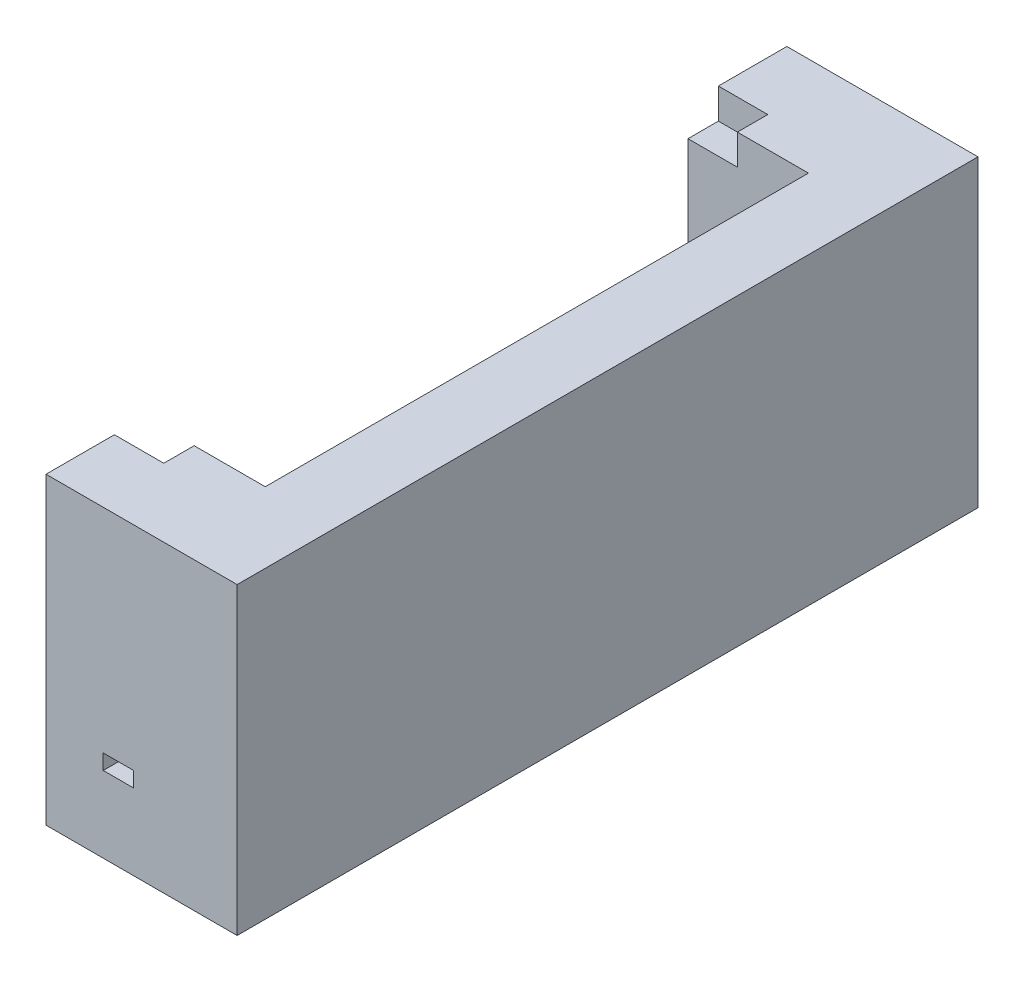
ISO-10303-21;
HEADER;
FILE_DESCRIPTION(('STEP AP214'),'2;1');
FILE_NAME('part.step','',(''),(''),'','','');
FILE_SCHEMA(('AUTOMOTIVE_DESIGN { 1 0 10303 214 1 1 1 1 }'));
ENDSEC;
DATA;
#1=APPLICATION_CONTEXT('core data for automotive mechanical design processes');
#2=APPLICATION_PROTOCOL_DEFINITION('international standard','automotive_design',2000,#1);
#3=PRODUCT_CONTEXT('',#1,'mechanical');
#4=PRODUCT('Part','Part','',(#3));
#5=PRODUCT_RELATED_PRODUCT_CATEGORY('part','',(#4));
#6=PRODUCT_DEFINITION_FORMATION('','',#4);
#7=PRODUCT_DEFINITION_CONTEXT('part definition',#1,'design');
#8=PRODUCT_DEFINITION('design','',#6,#7);
#9=PRODUCT_DEFINITION_SHAPE('','',#8);
#10=(LENGTH_UNIT() NAMED_UNIT(*) SI_UNIT(.MILLI.,.METRE.));
#11=(NAMED_UNIT(*) PLANE_ANGLE_UNIT() SI_UNIT($,.RADIAN.));
#12=(NAMED_UNIT(*) SI_UNIT($,.STERADIAN.) SOLID_ANGLE_UNIT());
#13=UNCERTAINTY_MEASURE_WITH_UNIT(LENGTH_MEASURE(1.E-05),#10,'distance_accuracy_value','');
#14=(GEOMETRIC_REPRESENTATION_CONTEXT(3) GLOBAL_UNCERTAINTY_ASSIGNED_CONTEXT((#13)) GLOBAL_UNIT_ASSIGNED_CONTEXT((#10,
#11,#12)) REPRESENTATION_CONTEXT('',''));
#15=CARTESIAN_POINT('',(0.,0.,0.));
#16=DIRECTION('',(0.,0.,1.));
#17=DIRECTION('',(1.,0.,0.));
#18=AXIS2_PLACEMENT_3D('',#15,#16,#17);
#19=CARTESIAN_POINT('',(39.5032063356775,22.3385551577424,0.));
#20=DIRECTION('',(-1.,0.,0.));
#21=DIRECTION('',(0.,0.,1.));
#22=AXIS2_PLACEMENT_3D('',#19,#20,#21);
#23=PLANE('',#22);
#24=DIRECTION('',(0.,0.,-1.));
#25=VECTOR('',#24,1.);
#26=CARTESIAN_POINT('',(39.5032063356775,19.9385551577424,0.));
#27=LINE('',#26,#25);
#28=CARTESIAN_POINT('',(39.5032063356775,19.9385551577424,14.9045368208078));
#29=VERTEX_POINT('',#28);
#30=CARTESIAN_POINT('',(39.5032063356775,19.9385551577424,-0.109398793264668));
#31=VERTEX_POINT('',#30);
#32=EDGE_CURVE('E406',#29,#31,#27,.T.);
#33=ORIENTED_EDGE('',*,*,#32,.T.);
#34=DIRECTION('',(0.,-1.,0.));
#35=VECTOR('',#34,1.);
#36=CARTESIAN_POINT('',(39.5032063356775,19.9385551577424,-0.10939879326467));
#37=LINE('',#36,#35);
#38=CARTESIAN_POINT('',(39.5032063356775,12.3385551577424,-0.10939879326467));
#39=VERTEX_POINT('',#38);
#40=EDGE_CURVE('E378',#31,#39,#37,.T.);
#41=ORIENTED_EDGE('',*,*,#40,.T.);
#42=DIRECTION('',(0.,0.,1.));
#43=VECTOR('',#42,1.);
#44=CARTESIAN_POINT('',(39.5032063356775,12.3385551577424,0.));
#45=LINE('',#44,#43);
#46=CARTESIAN_POINT('',(39.5032063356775,12.3385551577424,14.9045368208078));
#47=VERTEX_POINT('',#46);
#48=EDGE_CURVE('E137',#39,#47,#45,.T.);
#49=ORIENTED_EDGE('',*,*,#48,.T.);
#50=DIRECTION('',(0.,-1.,0.));
#51=VECTOR('',#50,1.);
#52=CARTESIAN_POINT('',(39.5032063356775,19.9385551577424,14.9045368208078));
#53=LINE('',#52,#51);
#54=EDGE_CURVE('E396',#29,#47,#53,.T.);
#55=ORIENTED_EDGE('',*,*,#54,.F.);
#56=EDGE_LOOP('',(#33,#41,#49,#55));
#57=FACE_BOUND('',#56,.T.);
#58=ADVANCED_FACE('F129',(#57),#23,.T.);
#59=CARTESIAN_POINT('',(31.8495376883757,22.3385551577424,0.));
#60=DIRECTION('',(-1.,0.,0.));
#61=DIRECTION('',(0.,0.,1.));
#62=AXIS2_PLACEMENT_3D('',#59,#60,#61);
#63=PLANE('',#62);
#64=DIRECTION('',(0.,0.,1.));
#65=VECTOR('',#64,1.);
#66=CARTESIAN_POINT('',(31.8495376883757,19.9385551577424,-14.9412263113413));
#67=LINE('',#66,#65);
#68=CARTESIAN_POINT('',(31.8495376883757,19.9385551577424,-11.8264503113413));
#69=VERTEX_POINT('',#68);
#70=CARTESIAN_POINT('',(31.8495376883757,19.9385551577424,-0.109398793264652));
#71=VERTEX_POINT('',#70);
#72=EDGE_CURVE('E345',#69,#71,#67,.T.);
#73=ORIENTED_EDGE('',*,*,#72,.F.);
#74=DIRECTION('',(0.,-1.,0.));
#75=VECTOR('',#74,1.);
#76=CARTESIAN_POINT('',(31.8495376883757,42.3385551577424,-11.8264503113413));
#77=LINE('',#76,#75);
#78=CARTESIAN_POINT('',(31.8495376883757,22.3385551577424,-11.8264502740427));
#79=VERTEX_POINT('',#78);
#80=EDGE_CURVE('E357',#79,#69,#77,.T.);
#81=ORIENTED_EDGE('',*,*,#80,.F.);
#82=DIRECTION('',(0.,0.,-1.));
#83=VECTOR('',#82,1.);
#84=CARTESIAN_POINT('',(31.8495376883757,22.3385551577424,0.));
#85=LINE('',#84,#83);
#86=CARTESIAN_POINT('',(31.8495376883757,22.3385551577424,59.6587736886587));
#87=VERTEX_POINT('',#86);
#88=EDGE_CURVE('E608',#87,#79,#85,.T.);
#89=ORIENTED_EDGE('',*,*,#88,.F.);
#90=DIRECTION('',(0.,1.,0.));
#91=VECTOR('',#90,1.);
#92=CARTESIAN_POINT('',(31.8495376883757,42.3385551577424,59.6587736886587));
#93=LINE('',#92,#91);
#94=CARTESIAN_POINT('',(31.8495376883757,19.9385551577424,59.6587736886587));
#95=VERTEX_POINT('',#94);
#96=EDGE_CURVE('E363',#95,#87,#93,.T.);
#97=ORIENTED_EDGE('',*,*,#96,.F.);
#98=CARTESIAN_POINT('',(31.8495376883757,19.9385551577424,46.7045368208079));
#99=VERTEX_POINT('',#98);
#100=EDGE_CURVE('E399',#99,#95,#67,.T.);
#101=ORIENTED_EDGE('',*,*,#100,.F.);
#102=DIRECTION('',(0.,-1.,0.));
#103=VECTOR('',#102,1.);
#104=CARTESIAN_POINT('',(31.8495376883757,20.0885551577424,46.7045368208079));
#105=LINE('',#104,#103);
#106=CARTESIAN_POINT('',(31.8495376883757,12.3385551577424,46.7045368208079));
#107=VERTEX_POINT('',#106);
#108=EDGE_CURVE('E428',#99,#107,#105,.T.);
#109=ORIENTED_EDGE('',*,*,#108,.T.);
#110=DIRECTION('',(0.,0.,1.));
#111=VECTOR('',#110,1.);
#112=CARTESIAN_POINT('',(31.8495376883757,12.3385551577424,48.4363643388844));
#113=LINE('',#112,#111);
#114=CARTESIAN_POINT('',(31.8495376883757,12.3385551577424,31.6906012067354));
#115=VERTEX_POINT('',#114);
#116=EDGE_CURVE('E611',#115,#107,#113,.T.);
#117=ORIENTED_EDGE('',*,*,#116,.F.);
#118=DIRECTION('',(0.,-1.,0.));
#119=VECTOR('',#118,1.);
#120=CARTESIAN_POINT('',(31.8495376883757,20.0885551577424,31.6906012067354));
#121=LINE('',#120,#119);
#122=CARTESIAN_POINT('',(31.8495376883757,19.9385551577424,31.6906012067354));
#123=VERTEX_POINT('',#122);
#124=EDGE_CURVE('E422',#123,#115,#121,.T.);
#125=ORIENTED_EDGE('',*,*,#124,.F.);
#126=CARTESIAN_POINT('',(31.8495376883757,19.9385551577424,14.9045368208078));
#127=VERTEX_POINT('',#126);
#128=EDGE_CURVE('E400',#127,#123,#67,.T.);
#129=ORIENTED_EDGE('',*,*,#128,.F.);
#130=DIRECTION('',(0.,-1.,0.));
#131=VECTOR('',#130,1.);
#132=CARTESIAN_POINT('',(31.8495376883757,19.9385551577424,14.9045368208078));
#133=LINE('',#132,#131);
#134=CARTESIAN_POINT('',(31.8495376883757,12.3385551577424,14.9045368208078));
#135=VERTEX_POINT('',#134);
#136=EDGE_CURVE('E392',#127,#135,#133,.T.);
#137=ORIENTED_EDGE('',*,*,#136,.T.);
#138=DIRECTION('',(0.,0.,-1.));
#139=VECTOR('',#138,1.);
#140=CARTESIAN_POINT('',(31.8495376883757,12.3385551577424,0.));
#141=LINE('',#140,#139);
#142=CARTESIAN_POINT('',(31.8495376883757,12.3385551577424,-0.109398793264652));
#143=VERTEX_POINT('',#142);
#144=EDGE_CURVE('E617',#135,#143,#141,.T.);
#145=ORIENTED_EDGE('',*,*,#144,.T.);
#146=DIRECTION('',(0.,-1.,0.));
#147=VECTOR('',#146,1.);
#148=CARTESIAN_POINT('',(31.8495376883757,19.9385551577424,-0.109398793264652));
#149=LINE('',#148,#147);
#150=EDGE_CURVE('E375',#71,#143,#149,.T.);
#151=ORIENTED_EDGE('',*,*,#150,.F.);
#152=EDGE_LOOP('',(#73,#81,#89,#97,#101,#109,#117,#125,#129,#137,#145,#151));
#153=FACE_BOUND('',#152,.T.);
#154=ADVANCED_FACE('F654',(#153),#63,.F.);
#155=DIRECTION('',(0.,-1.,0.));
#156=VECTOR('',#155,1.);
#157=CARTESIAN_POINT('',(39.5032063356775,20.0885551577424,46.7045368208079));
#158=LINE('',#157,#156);
#159=CARTESIAN_POINT('',(39.5032063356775,19.9385551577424,46.7045368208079));
#160=VERTEX_POINT('',#159);
#161=CARTESIAN_POINT('',(39.5032063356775,12.3385551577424,46.7045368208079));
#162=VERTEX_POINT('',#161);
#163=EDGE_CURVE('E430',#160,#162,#158,.T.);
#164=ORIENTED_EDGE('',*,*,#163,.F.);
#165=DIRECTION('',(0.,0.,-1.));
#166=VECTOR('',#165,1.);
#167=CARTESIAN_POINT('',(39.5032063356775,19.9385551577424,0.));
#168=LINE('',#167,#166);
#169=CARTESIAN_POINT('',(39.5032063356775,19.9385551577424,31.6906012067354));
#170=VERTEX_POINT('',#169);
#171=EDGE_CURVE('E344',#160,#170,#168,.T.);
#172=ORIENTED_EDGE('',*,*,#171,.T.);
#173=DIRECTION('',(0.,-1.,0.));
#174=VECTOR('',#173,1.);
#175=CARTESIAN_POINT('',(39.5032063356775,20.0885551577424,31.6906012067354));
#176=LINE('',#175,#174);
#177=CARTESIAN_POINT('',(39.5032063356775,12.3385551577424,31.6906012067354));
#178=VERTEX_POINT('',#177);
#179=EDGE_CURVE('E420',#170,#178,#176,.T.);
#180=ORIENTED_EDGE('',*,*,#179,.T.);
#181=DIRECTION('',(0.,0.,-1.));
#182=VECTOR('',#181,1.);
#183=CARTESIAN_POINT('',(39.5032063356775,12.3385551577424,29.9587736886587));
#184=LINE('',#183,#182);
#185=EDGE_CURVE('E614',#162,#178,#184,.T.);
#186=ORIENTED_EDGE('',*,*,#185,.F.);
#187=EDGE_LOOP('',(#164,#172,#180,#186));
#188=FACE_BOUND('',#187,.T.);
#189=ADVANCED_FACE('F707',(#188),#23,.T.);
#190=CARTESIAN_POINT('',(35.6763720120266,20.0885551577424,39.1975690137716));
#191=DIRECTION('',(0.,-1.,0.));
#192=DIRECTION('',(0.,0.,-1.));
#193=AXIS2_PLACEMENT_3D('',#190,#191,#192);
#194=CYLINDRICAL_SURFACE('',#193,8.42610388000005);
#195=CARTESIAN_POINT('',(35.6763720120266,19.9385551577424,39.1975690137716));
#196=DIRECTION('',(0.,1.,0.));
#197=DIRECTION('',(0.,0.,1.));
#198=AXIS2_PLACEMENT_3D('',#195,#196,#197);
#199=CIRCLE('',#198,8.42610388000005);
#200=EDGE_CURVE('E404',#160,#99,#199,.F.);
#201=ORIENTED_EDGE('',*,*,#200,.F.);
#202=ORIENTED_EDGE('',*,*,#163,.T.);
#203=CARTESIAN_POINT('',(35.6763720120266,12.3385551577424,39.1975690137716));
#204=DIRECTION('',(0.,1.,0.));
#205=DIRECTION('',(0.,0.,1.));
#206=AXIS2_PLACEMENT_3D('',#203,#204,#205);
#207=CIRCLE('',#206,8.42610388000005);
#208=CARTESIAN_POINT('',(35.8797435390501,12.3385551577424,47.621218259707));
#209=VERTEX_POINT('',#208);
#210=EDGE_CURVE('E425',#162,#209,#207,.F.);
#211=ORIENTED_EDGE('',*,*,#210,.T.);
#212=DIRECTION('',(0.,-1.,0.));
#213=VECTOR('',#212,1.);
#214=CARTESIAN_POINT('',(35.8797435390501,20.0885551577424,47.621218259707));
#215=LINE('',#214,#213);
#216=CARTESIAN_POINT('',(35.8797435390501,14.3385551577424,47.621218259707));
#217=VERTEX_POINT('',#216);
#218=EDGE_CURVE('E408',#217,#209,#215,.T.);
#219=ORIENTED_EDGE('',*,*,#218,.F.);
#220=CARTESIAN_POINT('',(35.6763720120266,14.3385551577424,39.1975690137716));
#221=DIRECTION('',(0.,1.,0.));
#222=DIRECTION('',(0.,0.,1.));
#223=AXIS2_PLACEMENT_3D('',#220,#221,#222);
#224=CIRCLE('',#223,8.42610388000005);
#225=CARTESIAN_POINT('',(31.8797435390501,14.3385551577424,46.7198584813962));
#226=VERTEX_POINT('',#225);
#227=EDGE_CURVE('E411',#226,#217,#224,.T.);
#228=ORIENTED_EDGE('',*,*,#227,.F.);
#229=DIRECTION('',(0.,-1.,0.));
#230=VECTOR('',#229,1.);
#231=CARTESIAN_POINT('',(31.8797435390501,20.0885551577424,46.7198584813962));
#232=LINE('',#231,#230);
#233=CARTESIAN_POINT('',(31.8797435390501,12.3385551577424,46.7198584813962));
#234=VERTEX_POINT('',#233);
#235=EDGE_CURVE('E414',#234,#226,#232,.F.);
#236=ORIENTED_EDGE('',*,*,#235,.F.);
#237=EDGE_CURVE('E424',#234,#107,#207,.F.);
#238=ORIENTED_EDGE('',*,*,#237,.T.);
#239=ORIENTED_EDGE('',*,*,#108,.F.);
#240=EDGE_LOOP('',(#201,#202,#211,#219,#228,#236,#238,#239));
#241=FACE_BOUND('',#240,.T.);
#242=ADVANCED_FACE('F714',(#241),#194,.F.);
#243=CARTESIAN_POINT('',(35.6763720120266,20.0885551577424,39.1975690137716));
#244=DIRECTION('',(0.,-1.,0.));
#245=DIRECTION('',(0.,0.,-1.));
#246=AXIS2_PLACEMENT_3D('',#243,#244,#245);
#247=CYLINDRICAL_SURFACE('',#246,8.42610387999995);
#248=CARTESIAN_POINT('',(35.6763720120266,19.9385551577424,39.1975690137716));
#249=DIRECTION('',(0.,1.,0.));
#250=DIRECTION('',(0.,0.,1.));
#251=AXIS2_PLACEMENT_3D('',#248,#249,#250);
#252=CIRCLE('',#251,8.42610387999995);
#253=EDGE_CURVE('E12',#123,#170,#252,.F.);
#254=ORIENTED_EDGE('',*,*,#253,.F.);
#255=ORIENTED_EDGE('',*,*,#124,.T.);
#256=CARTESIAN_POINT('',(35.6763720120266,12.3385551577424,39.1975690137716));
#257=DIRECTION('',(0.,1.,0.));
#258=DIRECTION('',(0.,0.,1.));
#259=AXIS2_PLACEMENT_3D('',#256,#257,#258);
#260=CIRCLE('',#259,8.42610387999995);
#261=EDGE_CURVE('E417',#115,#178,#260,.F.);
#262=ORIENTED_EDGE('',*,*,#261,.T.);
#263=ORIENTED_EDGE('',*,*,#179,.F.);
#264=EDGE_LOOP('',(#254,#255,#262,#263));
#265=FACE_BOUND('',#264,.T.);
#266=ADVANCED_FACE('F719',(#265),#247,.F.);
#267=CARTESIAN_POINT('',(31.8797435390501,12.3385551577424,43.1587736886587));
#268=DIRECTION('',(0.,-1.,0.));
#269=DIRECTION('',(0.,0.,-1.));
#270=AXIS2_PLACEMENT_3D('',#267,#268,#269);
#271=PLANE('',#270);
#272=CARTESIAN_POINT('',(34.,12.3385551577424,51.074021));
#273=DIRECTION('',(0.,1.,0.));
#274=DIRECTION('',(0.,0.,1.));
#275=AXIS2_PLACEMENT_3D('',#272,#273,#274);
#276=CIRCLE('',#275,1.5);
#277=CARTESIAN_POINT('',(34.,12.3385551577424,52.574021));
#278=VERTEX_POINT('',#277);
#279=EDGE_CURVE('E566',#278,#278,#276,.T.);
#280=ORIENTED_EDGE('',*,*,#279,.F.);
#281=EDGE_LOOP('',(#280));
#282=FACE_BOUND('',#281,.T.);
#283=CARTESIAN_POINT('',(34.,12.3385551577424,54.274021));
#284=DIRECTION('',(0.,1.,0.));
#285=DIRECTION('',(0.,0.,1.));
#286=AXIS2_PLACEMENT_3D('',#283,#284,#285);
#287=CIRCLE('',#286,1.5);
#288=CARTESIAN_POINT('',(34.,12.3385551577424,55.774021));
#289=VERTEX_POINT('',#288);
#290=EDGE_CURVE('E578',#289,#289,#287,.T.);
#291=ORIENTED_EDGE('',*,*,#290,.F.);
#292=EDGE_LOOP('',(#291));
#293=FACE_BOUND('',#292,.T.);
#294=CARTESIAN_POINT('',(34.,12.3385551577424,57.474021));
#295=DIRECTION('',(0.,1.,0.));
#296=DIRECTION('',(0.,0.,1.));
#297=AXIS2_PLACEMENT_3D('',#294,#295,#296);
#298=CIRCLE('',#297,1.5);
#299=CARTESIAN_POINT('',(34.,12.3385551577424,58.974021));
#300=VERTEX_POINT('',#299);
#301=EDGE_CURVE('E590',#300,#300,#298,.T.);
#302=ORIENTED_EDGE('',*,*,#301,.F.);
#303=EDGE_LOOP('',(#302));
#304=FACE_BOUND('',#303,.T.);
#305=DIRECTION('',(0.,0.,1.));
#306=VECTOR('',#305,1.);
#307=CARTESIAN_POINT('',(35.8797435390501,12.3385551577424,47.9587736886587));
#308=LINE('',#307,#306);
#309=CARTESIAN_POINT('',(35.8797435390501,12.3385551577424,72.6587736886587));
#310=VERTEX_POINT('',#309);
#311=EDGE_CURVE('E517',#209,#310,#308,.T.);
#312=ORIENTED_EDGE('',*,*,#311,.F.);
#313=ORIENTED_EDGE('',*,*,#210,.F.);
#314=ORIENTED_EDGE('',*,*,#185,.T.);
#315=ORIENTED_EDGE('',*,*,#261,.F.);
#316=ORIENTED_EDGE('',*,*,#116,.T.);
#317=ORIENTED_EDGE('',*,*,#237,.F.);
#318=DIRECTION('',(0.,0.,1.));
#319=VECTOR('',#318,1.);
#320=CARTESIAN_POINT('',(31.8797435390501,12.3385551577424,43.1587736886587));
#321=LINE('',#320,#319);
#322=CARTESIAN_POINT('',(31.8797435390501,12.3385551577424,72.6587736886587));
#323=VERTEX_POINT('',#322);
#324=EDGE_CURVE('E586',#234,#323,#321,.T.);
#325=ORIENTED_EDGE('',*,*,#324,.T.);
#326=DIRECTION('',(-1.,0.,0.));
#327=VECTOR('',#326,1.);
#328=CARTESIAN_POINT('',(0.,12.3385551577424,72.6587736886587));
#329=LINE('',#328,#327);
#330=EDGE_CURVE('E450',#310,#323,#329,.T.);
#331=ORIENTED_EDGE('',*,*,#330,.F.);
#332=EDGE_LOOP('',(#312,#313,#314,#315,#316,#317,#325,#331));
#333=FACE_BOUND('',#332,.T.);
#334=ADVANCED_FACE('F728',(#282,#293,#304,#333),#271,.F.);
#335=CARTESIAN_POINT('',(31.8797435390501,12.3385551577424,43.1587736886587));
#336=DIRECTION('',(-1.,0.,0.));
#337=DIRECTION('',(0.,0.,1.));
#338=AXIS2_PLACEMENT_3D('',#335,#336,#337);
#339=PLANE('',#338);
#340=ORIENTED_EDGE('',*,*,#324,.F.);
#341=ORIENTED_EDGE('',*,*,#235,.T.);
#342=DIRECTION('',(0.,0.,1.));
#343=VECTOR('',#342,1.);
#344=CARTESIAN_POINT('',(31.8797435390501,14.3385551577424,43.1587736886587));
#345=LINE('',#344,#343);
#346=CARTESIAN_POINT('',(31.8797435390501,14.3385551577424,72.6587736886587));
#347=VERTEX_POINT('',#346);
#348=EDGE_CURVE('E595',#226,#347,#345,.T.);
#349=ORIENTED_EDGE('',*,*,#348,.T.);
#350=DIRECTION('',(0.,-1.,0.));
#351=VECTOR('',#350,1.);
#352=CARTESIAN_POINT('',(31.8797435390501,0.,72.6587736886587));
#353=LINE('',#352,#351);
#354=EDGE_CURVE('E453',#347,#323,#353,.T.);
#355=ORIENTED_EDGE('',*,*,#354,.T.);
#356=EDGE_LOOP('',(#340,#341,#349,#355));
#357=FACE_BOUND('',#356,.T.);
#358=ADVANCED_FACE('F743',(#357),#339,.F.);
#359=CARTESIAN_POINT('',(31.8797435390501,14.3385551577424,43.1587736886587));
#360=DIRECTION('',(0.,1.,0.));
#361=DIRECTION('',(0.,0.,1.));
#362=AXIS2_PLACEMENT_3D('',#359,#360,#361);
#363=PLANE('',#362);
#364=ORIENTED_EDGE('',*,*,#348,.F.);
#365=ORIENTED_EDGE('',*,*,#227,.T.);
#366=DIRECTION('',(0.,0.,1.));
#367=VECTOR('',#366,1.);
#368=CARTESIAN_POINT('',(35.8797435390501,14.3385551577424,47.9587736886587));
#369=LINE('',#368,#367);
#370=CARTESIAN_POINT('',(35.8797435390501,14.3385551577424,72.6587736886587));
#371=VERTEX_POINT('',#370);
#372=EDGE_CURVE('E515',#217,#371,#369,.T.);
#373=ORIENTED_EDGE('',*,*,#372,.T.);
#374=DIRECTION('',(1.,0.,0.));
#375=VECTOR('',#374,1.);
#376=CARTESIAN_POINT('',(0.,14.3385551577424,72.6587736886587));
#377=LINE('',#376,#375);
#378=EDGE_CURVE('E444',#347,#371,#377,.T.);
#379=ORIENTED_EDGE('',*,*,#378,.F.);
#380=EDGE_LOOP('',(#364,#365,#373,#379));
#381=FACE_BOUND('',#380,.T.);
#382=ADVANCED_FACE('F739',(#381),#363,.F.);
#383=CARTESIAN_POINT('',(35.8797435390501,0.,47.9587736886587));
#384=DIRECTION('',(-1.,0.,0.));
#385=DIRECTION('',(0.,0.,1.));
#386=AXIS2_PLACEMENT_3D('',#383,#384,#385);
#387=PLANE('',#386);
#388=ORIENTED_EDGE('',*,*,#372,.F.);
#389=ORIENTED_EDGE('',*,*,#218,.T.);
#390=ORIENTED_EDGE('',*,*,#311,.T.);
#391=DIRECTION('',(0.,-1.,0.));
#392=VECTOR('',#391,1.);
#393=CARTESIAN_POINT('',(35.8797435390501,0.,72.6587736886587));
#394=LINE('',#393,#392);
#395=EDGE_CURVE('E447',#371,#310,#394,.T.);
#396=ORIENTED_EDGE('',*,*,#395,.F.);
#397=EDGE_LOOP('',(#388,#389,#390,#396));
#398=FACE_BOUND('',#397,.T.);
#399=ADVANCED_FACE('F733',(#398),#387,.T.);
#400=CARTESIAN_POINT('',(30.8495376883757,38.3385551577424,0.));
#401=DIRECTION('',(1.,0.,0.));
#402=DIRECTION('',(0.,0.,-1.));
#403=AXIS2_PLACEMENT_3D('',#400,#401,#402);
#404=PLANE('',#403);
#405=DIRECTION('',(0.,1.,0.));
#406=VECTOR('',#405,1.);
#407=CARTESIAN_POINT('',(30.8495376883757,38.3385551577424,-15.8264502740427));
#408=LINE('',#407,#406);
#409=CARTESIAN_POINT('',(30.8495376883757,38.3385551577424,-15.8264502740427));
#410=VERTEX_POINT('',#409);
#411=CARTESIAN_POINT('',(30.8495376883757,42.3385551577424,-15.8264502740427));
#412=VERTEX_POINT('',#411);
#413=EDGE_CURVE('E534',#410,#412,#408,.T.);
#414=ORIENTED_EDGE('',*,*,#413,.F.);
#415=DIRECTION('',(0.,0.,-1.));
#416=VECTOR('',#415,1.);
#417=CARTESIAN_POINT('',(30.8495376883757,38.3385551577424,0.));
#418=LINE('',#417,#416);
#419=CARTESIAN_POINT('',(30.8495376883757,38.3385551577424,-11.8264502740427));
#420=VERTEX_POINT('',#419);
#421=EDGE_CURVE('E528',#420,#410,#418,.T.);
#422=ORIENTED_EDGE('',*,*,#421,.F.);
#423=DIRECTION('',(0.,-1.,0.));
#424=VECTOR('',#423,1.);
#425=CARTESIAN_POINT('',(30.8495376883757,42.3385551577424,-11.8264502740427));
#426=LINE('',#425,#424);
#427=CARTESIAN_POINT('',(30.8495376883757,42.3385551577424,-11.8264502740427));
#428=VERTEX_POINT('',#427);
#429=EDGE_CURVE('E521',#428,#420,#426,.T.);
#430=ORIENTED_EDGE('',*,*,#429,.F.);
#431=DIRECTION('',(0.,0.,-1.));
#432=VECTOR('',#431,1.);
#433=CARTESIAN_POINT('',(30.8495376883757,42.3385551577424,0.));
#434=LINE('',#433,#432);
#435=EDGE_CURVE('E535',#428,#412,#434,.T.);
#436=ORIENTED_EDGE('',*,*,#435,.T.);
#437=EDGE_LOOP('',(#414,#422,#430,#436));
#438=FACE_BOUND('',#437,.T.);
#439=ADVANCED_FACE('F816',(#438),#404,.F.);
#440=CARTESIAN_POINT('',(0.,42.3385551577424,0.));
#441=DIRECTION('',(0.,1.,0.));
#442=DIRECTION('',(0.,0.,1.));
#443=AXIS2_PLACEMENT_3D('',#440,#441,#442);
#444=PLANE('',#443);
#445=DIRECTION('',(-1.,0.,0.));
#446=VECTOR('',#445,1.);
#447=CARTESIAN_POINT('',(30.8495376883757,42.3385551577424,-11.8264502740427));
#448=LINE('',#447,#446);
#449=CARTESIAN_POINT('',(40.2032063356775,42.3385551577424,-11.8264503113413));
#450=VERTEX_POINT('',#449);
#451=EDGE_CURVE('E144',#450,#428,#448,.T.);
#452=ORIENTED_EDGE('',*,*,#451,.F.);
#453=DIRECTION('',(0.,0.,-1.));
#454=VECTOR('',#453,1.);
#455=CARTESIAN_POINT('',(40.2032063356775,42.3385551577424,-14.9412263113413));
#456=LINE('',#455,#454);
#457=CARTESIAN_POINT('',(40.2032063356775,42.3385551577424,59.6587736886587));
#458=VERTEX_POINT('',#457);
#459=EDGE_CURVE('E350',#458,#450,#456,.T.);
#460=ORIENTED_EDGE('',*,*,#459,.F.);
#461=DIRECTION('',(-1.,0.,0.));
#462=VECTOR('',#461,1.);
#463=CARTESIAN_POINT('',(26.8495376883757,42.3385551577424,59.6587736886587));
#464=LINE('',#463,#462);
#465=CARTESIAN_POINT('',(30.8495376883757,42.3385551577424,59.6587736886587));
#466=VERTEX_POINT('',#465);
#467=EDGE_CURVE('E601',#458,#466,#464,.T.);
#468=ORIENTED_EDGE('',*,*,#467,.T.);
#469=DIRECTION('',(0.,0.,1.));
#470=VECTOR('',#469,1.);
#471=CARTESIAN_POINT('',(30.8495376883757,42.3385551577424,0.));
#472=LINE('',#471,#470);
#473=CARTESIAN_POINT('',(30.8495376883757,42.3385551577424,63.6587736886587));
#474=VERTEX_POINT('',#473);
#475=EDGE_CURVE('E525',#466,#474,#472,.T.);
#476=ORIENTED_EDGE('',*,*,#475,.T.);
#477=DIRECTION('',(1.,0.,0.));
#478=VECTOR('',#477,1.);
#479=CARTESIAN_POINT('',(0.,42.3385551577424,63.6587736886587));
#480=LINE('',#479,#478);
#481=CARTESIAN_POINT('',(24.3495376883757,42.3385551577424,63.6587736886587));
#482=VERTEX_POINT('',#481);
#483=EDGE_CURVE('E546',#482,#474,#480,.T.);
#484=ORIENTED_EDGE('',*,*,#483,.F.);
#485=DIRECTION('',(0.,0.,-1.));
#486=VECTOR('',#485,1.);
#487=CARTESIAN_POINT('',(24.3495376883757,42.3385551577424,63.6587736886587));
#488=LINE('',#487,#486);
#489=CARTESIAN_POINT('',(24.3495376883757,42.3385551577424,72.6587736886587));
#490=VERTEX_POINT('',#489);
#491=EDGE_CURVE('E482',#490,#482,#488,.T.);
#492=ORIENTED_EDGE('',*,*,#491,.F.);
#493=DIRECTION('',(-1.,0.,0.));
#494=VECTOR('',#493,1.);
#495=CARTESIAN_POINT('',(0.,42.3385551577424,72.6587736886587));
#496=LINE('',#495,#494);
#497=CARTESIAN_POINT('',(49.5032063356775,42.3385551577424,72.6587736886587));
#498=VERTEX_POINT('',#497);
#499=EDGE_CURVE('E438',#498,#490,#496,.T.);
#500=ORIENTED_EDGE('',*,*,#499,.F.);
#501=DIRECTION('',(0.,0.,1.));
#502=VECTOR('',#501,1.);
#503=CARTESIAN_POINT('',(49.5032063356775,42.3385551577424,71.6587736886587));
#504=LINE('',#503,#502);
#505=CARTESIAN_POINT('',(49.5032063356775,42.3385551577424,-24.8412263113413));
#506=VERTEX_POINT('',#505);
#507=EDGE_CURVE('E510',#506,#498,#504,.T.);
#508=ORIENTED_EDGE('',*,*,#507,.F.);
#509=DIRECTION('',(1.,0.,0.));
#510=VECTOR('',#509,1.);
#511=CARTESIAN_POINT('',(0.,42.3385551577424,-24.8412263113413));
#512=LINE('',#511,#510);
#513=CARTESIAN_POINT('',(24.3495376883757,42.3385551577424,-24.8412263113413));
#514=VERTEX_POINT('',#513);
#515=EDGE_CURVE('E474',#514,#506,#512,.T.);
#516=ORIENTED_EDGE('',*,*,#515,.F.);
#517=DIRECTION('',(0.,0.,-1.));
#518=VECTOR('',#517,1.);
#519=CARTESIAN_POINT('',(24.3495376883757,42.3385551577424,-23.8412263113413));
#520=LINE('',#519,#518);
#521=CARTESIAN_POINT('',(24.3495376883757,42.3385551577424,-15.8264502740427));
#522=VERTEX_POINT('',#521);
#523=EDGE_CURVE('E506',#522,#514,#520,.T.);
#524=ORIENTED_EDGE('',*,*,#523,.F.);
#525=DIRECTION('',(1.,0.,0.));
#526=VECTOR('',#525,1.);
#527=CARTESIAN_POINT('',(0.,42.3385551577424,-15.8264502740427));
#528=LINE('',#527,#526);
#529=EDGE_CURVE('E529',#522,#412,#528,.T.);
#530=ORIENTED_EDGE('',*,*,#529,.T.);
#531=ORIENTED_EDGE('',*,*,#435,.F.);
#532=EDGE_LOOP('',(#452,#460,#468,#476,#484,#492,#500,#508,#516,#524,#530,#531));
#533=FACE_BOUND('',#532,.T.);
#534=ADVANCED_FACE('F664',(#533),#444,.T.);
#535=CARTESIAN_POINT('',(0.,22.3385551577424,59.6587736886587));
#536=DIRECTION('',(0.,0.,-1.));
#537=DIRECTION('',(-1.,0.,0.));
#538=AXIS2_PLACEMENT_3D('',#535,#536,#537);
#539=PLANE('',#538);
#540=ORIENTED_EDGE('',*,*,#467,.F.);
#541=DIRECTION('',(0.,-1.,0.));
#542=VECTOR('',#541,1.);
#543=CARTESIAN_POINT('',(40.2032063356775,42.3385551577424,59.6587736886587));
#544=LINE('',#543,#542);
#545=CARTESIAN_POINT('',(40.2032063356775,19.9385551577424,59.6587736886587));
#546=VERTEX_POINT('',#545);
#547=EDGE_CURVE('E352',#458,#546,#544,.T.);
#548=ORIENTED_EDGE('',*,*,#547,.T.);
#549=DIRECTION('',(-1.,0.,0.));
#550=VECTOR('',#549,1.);
#551=CARTESIAN_POINT('',(40.2032063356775,19.9385551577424,59.6587736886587));
#552=LINE('',#551,#550);
#553=EDGE_CURVE('E340',#546,#95,#552,.T.);
#554=ORIENTED_EDGE('',*,*,#553,.T.);
#555=ORIENTED_EDGE('',*,*,#96,.T.);
#556=DIRECTION('',(-1.,0.,0.));
#557=VECTOR('',#556,1.);
#558=CARTESIAN_POINT('',(26.8495376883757,22.3385551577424,59.6587736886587));
#559=LINE('',#558,#557);
#560=CARTESIAN_POINT('',(24.3495376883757,22.3385551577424,59.6587736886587));
#561=VERTEX_POINT('',#560);
#562=EDGE_CURVE('E603',#87,#561,#559,.T.);
#563=ORIENTED_EDGE('',*,*,#562,.T.);
#564=DIRECTION('',(0.,-1.,0.));
#565=VECTOR('',#564,1.);
#566=CARTESIAN_POINT('',(24.3495376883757,22.3385551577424,59.6587736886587));
#567=LINE('',#566,#565);
#568=CARTESIAN_POINT('',(24.3495376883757,38.3385551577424,59.6587736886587));
#569=VERTEX_POINT('',#568);
#570=EDGE_CURVE('E491',#569,#561,#567,.T.);
#571=ORIENTED_EDGE('',*,*,#570,.F.);
#572=DIRECTION('',(-1.,0.,0.));
#573=VECTOR('',#572,1.);
#574=CARTESIAN_POINT('',(0.,38.3385551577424,59.6587736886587));
#575=LINE('',#574,#573);
#576=CARTESIAN_POINT('',(30.8495376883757,38.3385551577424,59.6587736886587));
#577=VERTEX_POINT('',#576);
#578=EDGE_CURVE('E545',#577,#569,#575,.T.);
#579=ORIENTED_EDGE('',*,*,#578,.F.);
#580=DIRECTION('',(0.,1.,0.));
#581=VECTOR('',#580,1.);
#582=CARTESIAN_POINT('',(30.8495376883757,38.3385551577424,59.6587736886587));
#583=LINE('',#582,#581);
#584=EDGE_CURVE('E551',#577,#466,#583,.T.);
#585=ORIENTED_EDGE('',*,*,#584,.T.);
#586=EDGE_LOOP('',(#540,#548,#554,#555,#563,#571,#579,#585));
#587=FACE_BOUND('',#586,.T.);
#588=ADVANCED_FACE('F663',(#587),#539,.T.);
#589=CARTESIAN_POINT('',(0.,12.3385551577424,0.));
#590=DIRECTION('',(0.,-1.,0.));
#591=DIRECTION('',(0.,0.,-1.));
#592=AXIS2_PLACEMENT_3D('',#589,#590,#591);
#593=PLANE('',#592);
#594=DIRECTION('',(0.,0.,-1.));
#595=VECTOR('',#594,1.);
#596=CARTESIAN_POINT('',(35.494659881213,12.3385551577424,-0.141226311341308));
#597=LINE('',#596,#595);
#598=CARTESIAN_POINT('',(35.494659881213,12.3385551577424,-1.02657529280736));
#599=VERTEX_POINT('',#598);
#600=CARTESIAN_POINT('',(35.494659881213,12.3385551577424,-24.8412263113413));
#601=VERTEX_POINT('',#600);
#602=EDGE_CURVE('E513',#599,#601,#597,.T.);
#603=ORIENTED_EDGE('',*,*,#602,.F.);
#604=CARTESIAN_POINT('',(35.6763720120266,12.3385551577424,7.39756901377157));
#605=DIRECTION('',(0.,1.,0.));
#606=DIRECTION('',(0.,0.,1.));
#607=AXIS2_PLACEMENT_3D('',#604,#605,#606);
#608=CIRCLE('',#607,8.42610388);
#609=EDGE_CURVE('E382',#143,#599,#608,.F.);
#610=ORIENTED_EDGE('',*,*,#609,.F.);
#611=ORIENTED_EDGE('',*,*,#144,.F.);
#612=CARTESIAN_POINT('',(35.6763720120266,12.3385551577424,7.39756901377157));
#613=DIRECTION('',(0.,1.,0.));
#614=DIRECTION('',(0.,0.,1.));
#615=AXIS2_PLACEMENT_3D('',#612,#613,#614);
#616=CIRCLE('',#615,8.42610388);
#617=EDGE_CURVE('E385',#135,#47,#616,.T.);
#618=ORIENTED_EDGE('',*,*,#617,.T.);
#619=ORIENTED_EDGE('',*,*,#48,.F.);
#620=CARTESIAN_POINT('',(39.494659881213,12.3385551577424,-0.113749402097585));
#621=VERTEX_POINT('',#620);
#622=EDGE_CURVE('E386',#621,#39,#608,.F.);
#623=ORIENTED_EDGE('',*,*,#622,.F.);
#624=DIRECTION('',(0.,0.,-1.));
#625=VECTOR('',#624,1.);
#626=CARTESIAN_POINT('',(39.494659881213,12.3385551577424,1.15877368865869));
#627=LINE('',#626,#625);
#628=CARTESIAN_POINT('',(39.494659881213,12.3385551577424,-24.8412263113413));
#629=VERTEX_POINT('',#628);
#630=EDGE_CURVE('E597',#621,#629,#627,.T.);
#631=ORIENTED_EDGE('',*,*,#630,.T.);
#632=DIRECTION('',(1.,0.,0.));
#633=VECTOR('',#632,1.);
#634=CARTESIAN_POINT('',(0.,12.3385551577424,-24.8412263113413));
#635=LINE('',#634,#633);
#636=EDGE_CURVE('E459',#601,#629,#635,.T.);
#637=ORIENTED_EDGE('',*,*,#636,.F.);
#638=EDGE_LOOP('',(#603,#610,#611,#618,#619,#623,#631,#637));
#639=FACE_BOUND('',#638,.T.);
#640=CARTESIAN_POINT('',(37.5,12.3385551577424,-4.60243094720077));
#641=DIRECTION('',(0.,1.,0.));
#642=DIRECTION('',(0.,0.,1.));
#643=AXIS2_PLACEMENT_3D('',#640,#641,#642);
#644=CIRCLE('',#643,1.5);
#645=CARTESIAN_POINT('',(37.5,12.3385551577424,-3.10243094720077));
#646=VERTEX_POINT('',#645);
#647=EDGE_CURVE('E563',#646,#646,#644,.T.);
#648=ORIENTED_EDGE('',*,*,#647,.F.);
#649=EDGE_LOOP('',(#648));
#650=FACE_BOUND('',#649,.T.);
#651=CARTESIAN_POINT('',(37.5,12.3385551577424,-7.802431));
#652=DIRECTION('',(0.,1.,0.));
#653=DIRECTION('',(0.,0.,1.));
#654=AXIS2_PLACEMENT_3D('',#651,#652,#653);
#655=CIRCLE('',#654,1.5);
#656=CARTESIAN_POINT('',(37.5,12.3385551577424,-6.302431));
#657=VERTEX_POINT('',#656);
#658=EDGE_CURVE('E575',#657,#657,#655,.T.);
#659=ORIENTED_EDGE('',*,*,#658,.F.);
#660=EDGE_LOOP('',(#659));
#661=FACE_BOUND('',#660,.T.);
#662=CARTESIAN_POINT('',(37.5,12.3385551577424,-11.002431));
#663=DIRECTION('',(0.,1.,0.));
#664=DIRECTION('',(0.,0.,1.));
#665=AXIS2_PLACEMENT_3D('',#662,#663,#664);
#666=CIRCLE('',#665,1.5);
#667=CARTESIAN_POINT('',(37.5,12.3385551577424,-9.502431));
#668=VERTEX_POINT('',#667);
#669=EDGE_CURVE('E587',#668,#668,#666,.T.);
#670=ORIENTED_EDGE('',*,*,#669,.F.);
#671=EDGE_LOOP('',(#670));
#672=FACE_BOUND('',#671,.T.);
#673=ADVANCED_FACE('F131',(#639,#650,#661,#672),#593,.F.);
#674=CARTESIAN_POINT('',(26.8495376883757,42.3385551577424,-11.8264502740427));
#675=DIRECTION('',(0.,0.,-1.));
#676=DIRECTION('',(-1.,0.,0.));
#677=AXIS2_PLACEMENT_3D('',#674,#675,#676);
#678=PLANE('',#677);
#679=DIRECTION('',(1.,0.,0.));
#680=VECTOR('',#679,1.);
#681=CARTESIAN_POINT('',(26.8495376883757,22.3385551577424,-11.8264502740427));
#682=LINE('',#681,#680);
#683=CARTESIAN_POINT('',(24.3495376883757,22.3385551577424,-11.8264502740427));
#684=VERTEX_POINT('',#683);
#685=EDGE_CURVE('E605',#684,#79,#682,.T.);
#686=ORIENTED_EDGE('',*,*,#685,.T.);
#687=ORIENTED_EDGE('',*,*,#80,.T.);
#688=DIRECTION('',(1.,0.,0.));
#689=VECTOR('',#688,1.);
#690=CARTESIAN_POINT('',(31.8495376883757,19.9385551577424,-11.8264503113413));
#691=LINE('',#690,#689);
#692=CARTESIAN_POINT('',(40.2032063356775,19.9385551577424,-11.8264503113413));
#693=VERTEX_POINT('',#692);
#694=EDGE_CURVE('E152',#69,#693,#691,.T.);
#695=ORIENTED_EDGE('',*,*,#694,.T.);
#696=DIRECTION('',(0.,1.,0.));
#697=VECTOR('',#696,1.);
#698=CARTESIAN_POINT('',(40.2032063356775,42.3385551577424,-11.8264503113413));
#699=LINE('',#698,#697);
#700=EDGE_CURVE('E348',#693,#450,#699,.T.);
#701=ORIENTED_EDGE('',*,*,#700,.T.);
#702=ORIENTED_EDGE('',*,*,#451,.T.);
#703=ORIENTED_EDGE('',*,*,#429,.T.);
#704=DIRECTION('',(1.,0.,0.));
#705=VECTOR('',#704,1.);
#706=CARTESIAN_POINT('',(0.,38.3385551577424,-11.8264502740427));
#707=LINE('',#706,#705);
#708=CARTESIAN_POINT('',(24.3495376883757,38.3385551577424,-11.8264502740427));
#709=VERTEX_POINT('',#708);
#710=EDGE_CURVE('E526',#709,#420,#707,.T.);
#711=ORIENTED_EDGE('',*,*,#710,.F.);
#712=DIRECTION('',(0.,1.,0.));
#713=VECTOR('',#712,1.);
#714=CARTESIAN_POINT('',(24.3495376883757,38.3385551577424,-11.8264502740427));
#715=LINE('',#714,#713);
#716=EDGE_CURVE('E497',#684,#709,#715,.T.);
#717=ORIENTED_EDGE('',*,*,#716,.F.);
#718=EDGE_LOOP('',(#686,#687,#695,#701,#702,#703,#711,#717));
#719=FACE_BOUND('',#718,.T.);
#720=ADVANCED_FACE('F356',(#719),#678,.F.);
#721=CARTESIAN_POINT('',(0.,22.3385551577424,0.));
#722=DIRECTION('',(0.,-1.,0.));
#723=DIRECTION('',(0.,0.,-1.));
#724=AXIS2_PLACEMENT_3D('',#721,#722,#723);
#725=PLANE('',#724);
#726=ORIENTED_EDGE('',*,*,#88,.T.);
#727=ORIENTED_EDGE('',*,*,#685,.F.);
#728=DIRECTION('',(0.,0.,-1.));
#729=VECTOR('',#728,1.);
#730=CARTESIAN_POINT('',(24.3495376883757,22.3385551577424,-11.8264502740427));
#731=LINE('',#730,#729);
#732=EDGE_CURVE('E494',#561,#684,#731,.T.);
#733=ORIENTED_EDGE('',*,*,#732,.F.);
#734=ORIENTED_EDGE('',*,*,#562,.F.);
#735=EDGE_LOOP('',(#726,#727,#733,#734));
#736=FACE_BOUND('',#735,.T.);
#737=ADVANCED_FACE('F893',(#736),#725,.F.);
#738=CARTESIAN_POINT('',(39.494659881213,12.3385551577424,1.15877368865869));
#739=DIRECTION('',(1.,0.,0.));
#740=DIRECTION('',(0.,0.,-1.));
#741=AXIS2_PLACEMENT_3D('',#738,#739,#740);
#742=PLANE('',#741);
#743=ORIENTED_EDGE('',*,*,#630,.F.);
#744=DIRECTION('',(0.,-1.,0.));
#745=VECTOR('',#744,1.);
#746=CARTESIAN_POINT('',(39.494659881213,19.9385551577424,-0.113749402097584));
#747=LINE('',#746,#745);
#748=CARTESIAN_POINT('',(39.494659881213,14.3385551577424,-0.113749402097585));
#749=VERTEX_POINT('',#748);
#750=EDGE_CURVE('E372',#749,#621,#747,.T.);
#751=ORIENTED_EDGE('',*,*,#750,.F.);
#752=DIRECTION('',(0.,0.,-1.));
#753=VECTOR('',#752,1.);
#754=CARTESIAN_POINT('',(39.494659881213,14.3385551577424,1.15877368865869));
#755=LINE('',#754,#753);
#756=CARTESIAN_POINT('',(39.494659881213,14.3385551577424,-24.8412263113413));
#757=VERTEX_POINT('',#756);
#758=EDGE_CURVE('E599',#749,#757,#755,.T.);
#759=ORIENTED_EDGE('',*,*,#758,.T.);
#760=DIRECTION('',(0.,1.,0.));
#761=VECTOR('',#760,1.);
#762=CARTESIAN_POINT('',(39.494659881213,0.,-24.8412263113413));
#763=LINE('',#762,#761);
#764=EDGE_CURVE('E462',#629,#757,#763,.T.);
#765=ORIENTED_EDGE('',*,*,#764,.F.);
#766=EDGE_LOOP('',(#743,#751,#759,#765));
#767=FACE_BOUND('',#766,.T.);
#768=ADVANCED_FACE('F646',(#767),#742,.F.);
#769=CARTESIAN_POINT('',(39.494659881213,14.3385551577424,1.15877368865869));
#770=DIRECTION('',(0.,1.,0.));
#771=DIRECTION('',(0.,0.,1.));
#772=AXIS2_PLACEMENT_3D('',#769,#770,#771);
#773=PLANE('',#772);
#774=ORIENTED_EDGE('',*,*,#758,.F.);
#775=CARTESIAN_POINT('',(35.6763720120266,14.3385551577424,7.39756901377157));
#776=DIRECTION('',(0.,1.,0.));
#777=DIRECTION('',(0.,0.,1.));
#778=AXIS2_PLACEMENT_3D('',#775,#776,#777);
#779=CIRCLE('',#778,8.42610388);
#780=CARTESIAN_POINT('',(35.494659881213,14.3385551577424,-1.02657529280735));
#781=VERTEX_POINT('',#780);
#782=EDGE_CURVE('E369',#781,#749,#779,.F.);
#783=ORIENTED_EDGE('',*,*,#782,.F.);
#784=DIRECTION('',(0.,0.,-1.));
#785=VECTOR('',#784,1.);
#786=CARTESIAN_POINT('',(35.494659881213,14.3385551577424,-0.141226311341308));
#787=LINE('',#786,#785);
#788=CARTESIAN_POINT('',(35.494659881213,14.3385551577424,-24.8412263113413));
#789=VERTEX_POINT('',#788);
#790=EDGE_CURVE('E512',#781,#789,#787,.T.);
#791=ORIENTED_EDGE('',*,*,#790,.T.);
#792=DIRECTION('',(-1.,0.,0.));
#793=VECTOR('',#792,1.);
#794=CARTESIAN_POINT('',(0.,14.3385551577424,-24.8412263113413));
#795=LINE('',#794,#793);
#796=EDGE_CURVE('E465',#757,#789,#795,.T.);
#797=ORIENTED_EDGE('',*,*,#796,.F.);
#798=EDGE_LOOP('',(#774,#783,#791,#797));
#799=FACE_BOUND('',#798,.T.);
#800=ADVANCED_FACE('F649',(#799),#773,.F.);
#801=CARTESIAN_POINT('',(0.,2.33855515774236,0.));
#802=DIRECTION('',(0.,1.,0.));
#803=DIRECTION('',(0.,0.,1.));
#804=AXIS2_PLACEMENT_3D('',#801,#802,#803);
#805=PLANE('',#804);
#806=DIRECTION('',(0.,0.,1.));
#807=VECTOR('',#806,1.);
#808=CARTESIAN_POINT('',(24.3495376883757,2.33855515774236,71.6587736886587));
#809=LINE('',#808,#807);
#810=CARTESIAN_POINT('',(24.3495376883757,2.33855515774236,-24.8412263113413));
#811=VERTEX_POINT('',#810);
#812=CARTESIAN_POINT('',(24.3495376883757,2.33855515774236,72.6587736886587));
#813=VERTEX_POINT('',#812);
#814=EDGE_CURVE('E480',#811,#813,#809,.T.);
#815=ORIENTED_EDGE('',*,*,#814,.F.);
#816=DIRECTION('',(-1.,0.,0.));
#817=VECTOR('',#816,1.);
#818=CARTESIAN_POINT('',(0.,2.33855515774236,-24.8412263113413));
#819=LINE('',#818,#817);
#820=CARTESIAN_POINT('',(49.5032063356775,2.33855515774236,-24.8412263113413));
#821=VERTEX_POINT('',#820);
#822=EDGE_CURVE('E468',#821,#811,#819,.T.);
#823=ORIENTED_EDGE('',*,*,#822,.F.);
#824=DIRECTION('',(0.,0.,-1.));
#825=VECTOR('',#824,1.);
#826=CARTESIAN_POINT('',(49.5032063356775,2.33855515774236,71.6587736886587));
#827=LINE('',#826,#825);
#828=CARTESIAN_POINT('',(49.5032063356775,2.33855515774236,72.6587736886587));
#829=VERTEX_POINT('',#828);
#830=EDGE_CURVE('E508',#829,#821,#827,.T.);
#831=ORIENTED_EDGE('',*,*,#830,.F.);
#832=DIRECTION('',(1.,0.,0.));
#833=VECTOR('',#832,1.);
#834=CARTESIAN_POINT('',(0.,2.33855515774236,72.6587736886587));
#835=LINE('',#834,#833);
#836=EDGE_CURVE('E432',#813,#829,#835,.T.);
#837=ORIENTED_EDGE('',*,*,#836,.F.);
#838=EDGE_LOOP('',(#815,#823,#831,#837));
#839=FACE_BOUND('',#838,.T.);
#840=ADVANCED_FACE('F691',(#839),#805,.F.);
#841=CARTESIAN_POINT('',(34.,10.3385551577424,57.474021));
#842=DIRECTION('',(0.,1.,0.));
#843=DIRECTION('',(0.,0.,1.));
#844=AXIS2_PLACEMENT_3D('',#841,#842,#843);
#845=CYLINDRICAL_SURFACE('',#844,1.5);
#846=CARTESIAN_POINT('',(34.,10.3385551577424,57.474021));
#847=DIRECTION('',(0.,1.,0.));
#848=DIRECTION('',(0.,0.,1.));
#849=AXIS2_PLACEMENT_3D('',#846,#847,#848);
#850=CIRCLE('',#849,1.5);
#851=CARTESIAN_POINT('',(34.,10.3385551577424,58.974021));
#852=VERTEX_POINT('',#851);
#853=EDGE_CURVE('E574',#852,#852,#850,.T.);
#854=ORIENTED_EDGE('',*,*,#853,.F.);
#855=EDGE_LOOP('',(#854));
#856=FACE_BOUND('',#855,.T.);
#857=ORIENTED_EDGE('',*,*,#301,.T.);
#858=EDGE_LOOP('',(#857));
#859=FACE_BOUND('',#858,.T.);
#860=ADVANCED_FACE('F1001',(#856,#859),#845,.F.);
#861=CARTESIAN_POINT('',(34.,10.3385551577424,57.474021));
#862=DIRECTION('',(0.,1.,0.));
#863=DIRECTION('',(0.,0.,1.));
#864=AXIS2_PLACEMENT_3D('',#861,#862,#863);
#865=PLANE('',#864);
#866=ORIENTED_EDGE('',*,*,#853,.T.);
#867=EDGE_LOOP('',(#866));
#868=FACE_BOUND('',#867,.T.);
#869=ADVANCED_FACE('F1176',(#868),#865,.T.);
#870=CARTESIAN_POINT('',(37.5,10.3385551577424,-11.002431));
#871=DIRECTION('',(0.,1.,0.));
#872=DIRECTION('',(0.,0.,1.));
#873=AXIS2_PLACEMENT_3D('',#870,#871,#872);
#874=CYLINDRICAL_SURFACE('',#873,1.5);
#875=CARTESIAN_POINT('',(37.5,10.3385551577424,-11.002431));
#876=DIRECTION('',(0.,1.,0.));
#877=DIRECTION('',(0.,0.,1.));
#878=AXIS2_PLACEMENT_3D('',#875,#876,#877);
#879=CIRCLE('',#878,1.5);
#880=CARTESIAN_POINT('',(37.5,10.3385551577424,-9.502431));
#881=VERTEX_POINT('',#880);
#882=EDGE_CURVE('E583',#881,#881,#879,.T.);
#883=ORIENTED_EDGE('',*,*,#882,.F.);
#884=EDGE_LOOP('',(#883));
#885=FACE_BOUND('',#884,.T.);
#886=ORIENTED_EDGE('',*,*,#669,.T.);
#887=EDGE_LOOP('',(#886));
#888=FACE_BOUND('',#887,.T.);
#889=ADVANCED_FACE('F1165',(#885,#888),#874,.F.);
#890=CARTESIAN_POINT('',(37.5,10.3385551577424,-11.002431));
#891=DIRECTION('',(0.,1.,0.));
#892=DIRECTION('',(0.,0.,1.));
#893=AXIS2_PLACEMENT_3D('',#890,#891,#892);
#894=PLANE('',#893);
#895=ORIENTED_EDGE('',*,*,#882,.T.);
#896=EDGE_LOOP('',(#895));
#897=FACE_BOUND('',#896,.T.);
#898=ADVANCED_FACE('F1154',(#897),#894,.T.);
#899=CARTESIAN_POINT('',(34.,9.13855515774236,54.274021));
#900=DIRECTION('',(0.,1.,0.));
#901=DIRECTION('',(0.,0.,1.));
#902=AXIS2_PLACEMENT_3D('',#899,#900,#901);
#903=CYLINDRICAL_SURFACE('',#902,1.5);
#904=CARTESIAN_POINT('',(34.,9.13855515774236,54.274021));
#905=DIRECTION('',(0.,1.,0.));
#906=DIRECTION('',(0.,0.,1.));
#907=AXIS2_PLACEMENT_3D('',#904,#905,#906);
#908=CIRCLE('',#907,1.5);
#909=CARTESIAN_POINT('',(34.,9.13855515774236,55.774021));
#910=VERTEX_POINT('',#909);
#911=EDGE_CURVE('E562',#910,#910,#908,.T.);
#912=ORIENTED_EDGE('',*,*,#911,.F.);
#913=EDGE_LOOP('',(#912));
#914=FACE_BOUND('',#913,.T.);
#915=ORIENTED_EDGE('',*,*,#290,.T.);
#916=EDGE_LOOP('',(#915));
#917=FACE_BOUND('',#916,.T.);
#918=ADVANCED_FACE('F1143',(#914,#917),#903,.F.);
#919=CARTESIAN_POINT('',(34.,9.13855515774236,54.274021));
#920=DIRECTION('',(0.,1.,0.));
#921=DIRECTION('',(0.,0.,1.));
#922=AXIS2_PLACEMENT_3D('',#919,#920,#921);
#923=PLANE('',#922);
#924=ORIENTED_EDGE('',*,*,#911,.T.);
#925=EDGE_LOOP('',(#924));
#926=FACE_BOUND('',#925,.T.);
#927=ADVANCED_FACE('F1132',(#926),#923,.T.);
#928=CARTESIAN_POINT('',(37.5,9.13855515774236,-7.802431));
#929=DIRECTION('',(0.,1.,0.));
#930=DIRECTION('',(0.,0.,1.));
#931=AXIS2_PLACEMENT_3D('',#928,#929,#930);
#932=CYLINDRICAL_SURFACE('',#931,1.5);
#933=CARTESIAN_POINT('',(37.5,9.13855515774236,-7.802431));
#934=DIRECTION('',(0.,1.,0.));
#935=DIRECTION('',(0.,0.,1.));
#936=AXIS2_PLACEMENT_3D('',#933,#934,#935);
#937=CIRCLE('',#936,1.5);
#938=CARTESIAN_POINT('',(37.5,9.13855515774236,-6.302431));
#939=VERTEX_POINT('',#938);
#940=EDGE_CURVE('E571',#939,#939,#937,.T.);
#941=ORIENTED_EDGE('',*,*,#940,.F.);
#942=EDGE_LOOP('',(#941));
#943=FACE_BOUND('',#942,.T.);
#944=ORIENTED_EDGE('',*,*,#658,.T.);
#945=EDGE_LOOP('',(#944));
#946=FACE_BOUND('',#945,.T.);
#947=ADVANCED_FACE('F1121',(#943,#946),#932,.F.);
#948=CARTESIAN_POINT('',(37.5,9.13855515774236,-7.802431));
#949=DIRECTION('',(0.,1.,0.));
#950=DIRECTION('',(0.,0.,1.));
#951=AXIS2_PLACEMENT_3D('',#948,#949,#950);
#952=PLANE('',#951);
#953=ORIENTED_EDGE('',*,*,#940,.T.);
#954=EDGE_LOOP('',(#953));
#955=FACE_BOUND('',#954,.T.);
#956=ADVANCED_FACE('F1110',(#955),#952,.T.);
#957=CARTESIAN_POINT('',(34.,7.53855515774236,51.074021));
#958=DIRECTION('',(0.,1.,0.));
#959=DIRECTION('',(0.,0.,1.));
#960=AXIS2_PLACEMENT_3D('',#957,#958,#959);
#961=CYLINDRICAL_SURFACE('',#960,1.5);
#962=CARTESIAN_POINT('',(34.,7.53855515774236,51.074021));
#963=DIRECTION('',(0.,1.,0.));
#964=DIRECTION('',(0.,0.,1.));
#965=AXIS2_PLACEMENT_3D('',#962,#963,#964);
#966=CIRCLE('',#965,1.5);
#967=CARTESIAN_POINT('',(34.,7.53855515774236,52.574021));
#968=VERTEX_POINT('',#967);
#969=EDGE_CURVE('E542',#968,#968,#966,.T.);
#970=ORIENTED_EDGE('',*,*,#969,.F.);
#971=EDGE_LOOP('',(#970));
#972=FACE_BOUND('',#971,.T.);
#973=ORIENTED_EDGE('',*,*,#279,.T.);
#974=EDGE_LOOP('',(#973));
#975=FACE_BOUND('',#974,.T.);
#976=ADVANCED_FACE('F1099',(#972,#975),#961,.F.);
#977=CARTESIAN_POINT('',(34.,7.53855515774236,51.074021));
#978=DIRECTION('',(0.,1.,0.));
#979=DIRECTION('',(0.,0.,1.));
#980=AXIS2_PLACEMENT_3D('',#977,#978,#979);
#981=PLANE('',#980);
#982=ORIENTED_EDGE('',*,*,#969,.T.);
#983=EDGE_LOOP('',(#982));
#984=FACE_BOUND('',#983,.T.);
#985=ADVANCED_FACE('F1088',(#984),#981,.T.);
#986=CARTESIAN_POINT('',(37.5,7.53855515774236,-4.60243094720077));
#987=DIRECTION('',(0.,1.,0.));
#988=DIRECTION('',(0.,0.,1.));
#989=AXIS2_PLACEMENT_3D('',#986,#987,#988);
#990=CYLINDRICAL_SURFACE('',#989,1.5);
#991=CARTESIAN_POINT('',(37.5,7.53855515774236,-4.60243094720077));
#992=DIRECTION('',(0.,1.,0.));
#993=DIRECTION('',(0.,0.,1.));
#994=AXIS2_PLACEMENT_3D('',#991,#992,#993);
#995=CIRCLE('',#994,1.5);
#996=CARTESIAN_POINT('',(37.5,7.53855515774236,-3.10243094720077));
#997=VERTEX_POINT('',#996);
#998=EDGE_CURVE('E559',#997,#997,#995,.T.);
#999=ORIENTED_EDGE('',*,*,#998,.F.);
#1000=EDGE_LOOP('',(#999));
#1001=FACE_BOUND('',#1000,.T.);
#1002=ORIENTED_EDGE('',*,*,#647,.T.);
#1003=EDGE_LOOP('',(#1002));
#1004=FACE_BOUND('',#1003,.T.);
#1005=ADVANCED_FACE('F1076',(#1001,#1004),#990,.F.);
#1006=CARTESIAN_POINT('',(37.5,7.53855515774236,-4.60243094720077));
#1007=DIRECTION('',(0.,1.,0.));
#1008=DIRECTION('',(0.,0.,1.));
#1009=AXIS2_PLACEMENT_3D('',#1006,#1007,#1008);
#1010=PLANE('',#1009);
#1011=ORIENTED_EDGE('',*,*,#998,.T.);
#1012=EDGE_LOOP('',(#1011));
#1013=FACE_BOUND('',#1012,.T.);
#1014=ADVANCED_FACE('F1066',(#1013),#1010,.T.);
#1015=CARTESIAN_POINT('',(30.8495376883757,38.3385551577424,0.));
#1016=DIRECTION('',(-1.,0.,0.));
#1017=DIRECTION('',(0.,0.,1.));
#1018=AXIS2_PLACEMENT_3D('',#1015,#1016,#1017);
#1019=PLANE('',#1018);
#1020=ORIENTED_EDGE('',*,*,#475,.F.);
#1021=ORIENTED_EDGE('',*,*,#584,.F.);
#1022=DIRECTION('',(0.,0.,1.));
#1023=VECTOR('',#1022,1.);
#1024=CARTESIAN_POINT('',(30.8495376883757,38.3385551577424,0.));
#1025=LINE('',#1024,#1023);
#1026=CARTESIAN_POINT('',(30.8495376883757,38.3385551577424,63.6587736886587));
#1027=VERTEX_POINT('',#1026);
#1028=EDGE_CURVE('E543',#577,#1027,#1025,.T.);
#1029=ORIENTED_EDGE('',*,*,#1028,.T.);
#1030=DIRECTION('',(0.,1.,0.));
#1031=VECTOR('',#1030,1.);
#1032=CARTESIAN_POINT('',(30.8495376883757,38.3385551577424,63.6587736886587));
#1033=LINE('',#1032,#1031);
#1034=EDGE_CURVE('E537',#1027,#474,#1033,.T.);
#1035=ORIENTED_EDGE('',*,*,#1034,.T.);
#1036=EDGE_LOOP('',(#1020,#1021,#1029,#1035));
#1037=FACE_BOUND('',#1036,.T.);
#1038=ADVANCED_FACE('F667',(#1037),#1019,.T.);
#1039=CARTESIAN_POINT('',(0.,38.3385551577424,63.6587736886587));
#1040=DIRECTION('',(0.,0.,1.));
#1041=DIRECTION('',(1.,0.,0.));
#1042=AXIS2_PLACEMENT_3D('',#1039,#1040,#1041);
#1043=PLANE('',#1042);
#1044=ORIENTED_EDGE('',*,*,#483,.T.);
#1045=ORIENTED_EDGE('',*,*,#1034,.F.);
#1046=DIRECTION('',(1.,0.,0.));
#1047=VECTOR('',#1046,1.);
#1048=CARTESIAN_POINT('',(0.,38.3385551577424,63.6587736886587));
#1049=LINE('',#1048,#1047);
#1050=CARTESIAN_POINT('',(24.3495376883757,38.3385551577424,63.6587736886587));
#1051=VERTEX_POINT('',#1050);
#1052=EDGE_CURVE('E548',#1051,#1027,#1049,.T.);
#1053=ORIENTED_EDGE('',*,*,#1052,.F.);
#1054=DIRECTION('',(0.,-1.,0.));
#1055=VECTOR('',#1054,1.);
#1056=CARTESIAN_POINT('',(24.3495376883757,38.3385551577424,63.6587736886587));
#1057=LINE('',#1056,#1055);
#1058=EDGE_CURVE('E485',#482,#1051,#1057,.T.);
#1059=ORIENTED_EDGE('',*,*,#1058,.F.);
#1060=EDGE_LOOP('',(#1044,#1045,#1053,#1059));
#1061=FACE_BOUND('',#1060,.T.);
#1062=ADVANCED_FACE('F681',(#1061),#1043,.F.);
#1063=CARTESIAN_POINT('',(0.,38.3385551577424,0.));
#1064=DIRECTION('',(0.,1.,0.));
#1065=DIRECTION('',(0.,0.,1.));
#1066=AXIS2_PLACEMENT_3D('',#1063,#1064,#1065);
#1067=PLANE('',#1066);
#1068=ORIENTED_EDGE('',*,*,#1028,.F.);
#1069=ORIENTED_EDGE('',*,*,#578,.T.);
#1070=DIRECTION('',(0.,0.,-1.));
#1071=VECTOR('',#1070,1.);
#1072=CARTESIAN_POINT('',(24.3495376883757,38.3385551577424,59.6587736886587));
#1073=LINE('',#1072,#1071);
#1074=EDGE_CURVE('E488',#1051,#569,#1073,.T.);
#1075=ORIENTED_EDGE('',*,*,#1074,.F.);
#1076=ORIENTED_EDGE('',*,*,#1052,.T.);
#1077=EDGE_LOOP('',(#1068,#1069,#1075,#1076));
#1078=FACE_BOUND('',#1077,.T.);
#1079=ADVANCED_FACE('F674',(#1078),#1067,.T.);
#1080=CARTESIAN_POINT('',(0.,38.3385551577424,-15.8264502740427));
#1081=DIRECTION('',(0.,0.,1.));
#1082=DIRECTION('',(1.,0.,0.));
#1083=AXIS2_PLACEMENT_3D('',#1080,#1081,#1082);
#1084=PLANE('',#1083);
#1085=ORIENTED_EDGE('',*,*,#529,.F.);
#1086=DIRECTION('',(0.,1.,0.));
#1087=VECTOR('',#1086,1.);
#1088=CARTESIAN_POINT('',(24.3495376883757,42.3385551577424,-15.8264502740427));
#1089=LINE('',#1088,#1087);
#1090=CARTESIAN_POINT('',(24.3495376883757,38.3385551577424,-15.8264502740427));
#1091=VERTEX_POINT('',#1090);
#1092=EDGE_CURVE('E503',#1091,#522,#1089,.T.);
#1093=ORIENTED_EDGE('',*,*,#1092,.F.);
#1094=DIRECTION('',(1.,0.,0.));
#1095=VECTOR('',#1094,1.);
#1096=CARTESIAN_POINT('',(0.,38.3385551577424,-15.8264502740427));
#1097=LINE('',#1096,#1095);
#1098=EDGE_CURVE('E531',#1091,#410,#1097,.T.);
#1099=ORIENTED_EDGE('',*,*,#1098,.T.);
#1100=ORIENTED_EDGE('',*,*,#413,.T.);
#1101=EDGE_LOOP('',(#1085,#1093,#1099,#1100));
#1102=FACE_BOUND('',#1101,.T.);
#1103=ADVANCED_FACE('F1018',(#1102),#1084,.T.);
#1104=CARTESIAN_POINT('',(0.,38.3385551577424,0.));
#1105=DIRECTION('',(0.,1.,0.));
#1106=DIRECTION('',(0.,0.,1.));
#1107=AXIS2_PLACEMENT_3D('',#1104,#1105,#1106);
#1108=PLANE('',#1107);
#1109=ORIENTED_EDGE('',*,*,#710,.T.);
#1110=ORIENTED_EDGE('',*,*,#421,.T.);
#1111=ORIENTED_EDGE('',*,*,#1098,.F.);
#1112=DIRECTION('',(0.,0.,-1.));
#1113=VECTOR('',#1112,1.);
#1114=CARTESIAN_POINT('',(24.3495376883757,38.3385551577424,-15.8264502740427));
#1115=LINE('',#1114,#1113);
#1116=EDGE_CURVE('E500',#709,#1091,#1115,.T.);
#1117=ORIENTED_EDGE('',*,*,#1116,.F.);
#1118=EDGE_LOOP('',(#1109,#1110,#1111,#1117));
#1119=FACE_BOUND('',#1118,.T.);
#1120=ADVANCED_FACE('F976',(#1119),#1108,.T.);
#1121=CARTESIAN_POINT('',(40.2032063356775,0.,0.));
#1122=DIRECTION('',(-1.,0.,0.));
#1123=DIRECTION('',(0.,0.,1.));
#1124=AXIS2_PLACEMENT_3D('',#1121,#1122,#1123);
#1125=PLANE('',#1124);
#1126=ORIENTED_EDGE('',*,*,#700,.F.);
#1127=DIRECTION('',(0.,0.,-1.));
#1128=VECTOR('',#1127,1.);
#1129=CARTESIAN_POINT('',(40.2032063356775,19.9385551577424,-14.9412263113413));
#1130=LINE('',#1129,#1128);
#1131=EDGE_CURVE('E336',#546,#693,#1130,.T.);
#1132=ORIENTED_EDGE('',*,*,#1131,.F.);
#1133=ORIENTED_EDGE('',*,*,#547,.F.);
#1134=ORIENTED_EDGE('',*,*,#459,.T.);
#1135=EDGE_LOOP('',(#1126,#1132,#1133,#1134));
#1136=FACE_BOUND('',#1135,.T.);
#1137=ADVANCED_FACE('F349',(#1136),#1125,.T.);
#1138=CARTESIAN_POINT('',(35.494659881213,0.,-0.141226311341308));
#1139=DIRECTION('',(1.,0.,0.));
#1140=DIRECTION('',(0.,0.,-1.));
#1141=AXIS2_PLACEMENT_3D('',#1138,#1139,#1140);
#1142=PLANE('',#1141);
#1143=ORIENTED_EDGE('',*,*,#790,.F.);
#1144=DIRECTION('',(0.,-1.,0.));
#1145=VECTOR('',#1144,1.);
#1146=CARTESIAN_POINT('',(35.494659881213,19.9385551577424,-1.02657529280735));
#1147=LINE('',#1146,#1145);
#1148=EDGE_CURVE('E366',#599,#781,#1147,.F.);
#1149=ORIENTED_EDGE('',*,*,#1148,.F.);
#1150=ORIENTED_EDGE('',*,*,#602,.T.);
#1151=DIRECTION('',(0.,-1.,0.));
#1152=VECTOR('',#1151,1.);
#1153=CARTESIAN_POINT('',(35.494659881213,0.,-24.8412263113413));
#1154=LINE('',#1153,#1152);
#1155=EDGE_CURVE('E456',#789,#601,#1154,.T.);
#1156=ORIENTED_EDGE('',*,*,#1155,.F.);
#1157=EDGE_LOOP('',(#1143,#1149,#1150,#1156));
#1158=FACE_BOUND('',#1157,.T.);
#1159=ADVANCED_FACE('F651',(#1158),#1142,.T.);
#1160=CARTESIAN_POINT('',(49.5032063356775,0.,0.));
#1161=DIRECTION('',(1.,0.,0.));
#1162=DIRECTION('',(0.,0.,-1.));
#1163=AXIS2_PLACEMENT_3D('',#1160,#1161,#1162);
#1164=PLANE('',#1163);
#1165=ORIENTED_EDGE('',*,*,#507,.T.);
#1166=DIRECTION('',(0.,1.,0.));
#1167=VECTOR('',#1166,1.);
#1168=CARTESIAN_POINT('',(49.5032063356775,0.,72.6587736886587));
#1169=LINE('',#1168,#1167);
#1170=EDGE_CURVE('E435',#829,#498,#1169,.T.);
#1171=ORIENTED_EDGE('',*,*,#1170,.F.);
#1172=ORIENTED_EDGE('',*,*,#830,.T.);
#1173=DIRECTION('',(0.,-1.,0.));
#1174=VECTOR('',#1173,1.);
#1175=CARTESIAN_POINT('',(49.5032063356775,0.,-24.8412263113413));
#1176=LINE('',#1175,#1174);
#1177=EDGE_CURVE('E477',#506,#821,#1176,.T.);
#1178=ORIENTED_EDGE('',*,*,#1177,.F.);
#1179=EDGE_LOOP('',(#1165,#1171,#1172,#1178));
#1180=FACE_BOUND('',#1179,.T.);
#1181=ADVANCED_FACE('F694',(#1180),#1164,.T.);
#1182=CARTESIAN_POINT('',(24.3495376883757,0.,0.));
#1183=DIRECTION('',(1.,0.,0.));
#1184=DIRECTION('',(0.,0.,-1.));
#1185=AXIS2_PLACEMENT_3D('',#1182,#1183,#1184);
#1186=PLANE('',#1185);
#1187=ORIENTED_EDGE('',*,*,#523,.T.);
#1188=DIRECTION('',(0.,1.,0.));
#1189=VECTOR('',#1188,1.);
#1190=CARTESIAN_POINT('',(24.3495376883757,0.,-24.8412263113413));
#1191=LINE('',#1190,#1189);
#1192=EDGE_CURVE('E471',#811,#514,#1191,.T.);
#1193=ORIENTED_EDGE('',*,*,#1192,.F.);
#1194=ORIENTED_EDGE('',*,*,#814,.T.);
#1195=DIRECTION('',(0.,-1.,0.));
#1196=VECTOR('',#1195,1.);
#1197=CARTESIAN_POINT('',(24.3495376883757,0.,72.6587736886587));
#1198=LINE('',#1197,#1196);
#1199=EDGE_CURVE('E441',#490,#813,#1198,.T.);
#1200=ORIENTED_EDGE('',*,*,#1199,.F.);
#1201=ORIENTED_EDGE('',*,*,#491,.T.);
#1202=ORIENTED_EDGE('',*,*,#1058,.T.);
#1203=ORIENTED_EDGE('',*,*,#1074,.T.);
#1204=ORIENTED_EDGE('',*,*,#570,.T.);
#1205=ORIENTED_EDGE('',*,*,#732,.T.);
#1206=ORIENTED_EDGE('',*,*,#716,.T.);
#1207=ORIENTED_EDGE('',*,*,#1116,.T.);
#1208=ORIENTED_EDGE('',*,*,#1092,.T.);
#1209=EDGE_LOOP('',(#1187,#1193,#1194,#1200,#1201,#1202,#1203,#1204,#1205,#1206,#1207,#1208));
#1210=FACE_BOUND('',#1209,.T.);
#1211=ADVANCED_FACE('F676',(#1210),#1186,.F.);
#1212=CARTESIAN_POINT('',(0.,0.,-24.8412263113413));
#1213=DIRECTION('',(0.,0.,-1.));
#1214=DIRECTION('',(-1.,0.,0.));
#1215=AXIS2_PLACEMENT_3D('',#1212,#1213,#1214);
#1216=PLANE('',#1215);
#1217=ORIENTED_EDGE('',*,*,#1155,.T.);
#1218=ORIENTED_EDGE('',*,*,#636,.T.);
#1219=ORIENTED_EDGE('',*,*,#764,.T.);
#1220=ORIENTED_EDGE('',*,*,#796,.T.);
#1221=EDGE_LOOP('',(#1217,#1218,#1219,#1220));
#1222=FACE_BOUND('',#1221,.T.);
#1223=ORIENTED_EDGE('',*,*,#822,.T.);
#1224=ORIENTED_EDGE('',*,*,#1192,.T.);
#1225=ORIENTED_EDGE('',*,*,#515,.T.);
#1226=ORIENTED_EDGE('',*,*,#1177,.T.);
#1227=EDGE_LOOP('',(#1223,#1224,#1225,#1226));
#1228=FACE_BOUND('',#1227,.T.);
#1229=ADVANCED_FACE('F642',(#1222,#1228),#1216,.T.);
#1230=CARTESIAN_POINT('',(0.,0.,72.6587736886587));
#1231=DIRECTION('',(0.,0.,1.));
#1232=DIRECTION('',(1.,0.,0.));
#1233=AXIS2_PLACEMENT_3D('',#1230,#1231,#1232);
#1234=PLANE('',#1233);
#1235=ORIENTED_EDGE('',*,*,#836,.T.);
#1236=ORIENTED_EDGE('',*,*,#1170,.T.);
#1237=ORIENTED_EDGE('',*,*,#499,.T.);
#1238=ORIENTED_EDGE('',*,*,#1199,.T.);
#1239=EDGE_LOOP('',(#1235,#1236,#1237,#1238));
#1240=FACE_BOUND('',#1239,.T.);
#1241=ORIENTED_EDGE('',*,*,#378,.T.);
#1242=ORIENTED_EDGE('',*,*,#395,.T.);
#1243=ORIENTED_EDGE('',*,*,#330,.T.);
#1244=ORIENTED_EDGE('',*,*,#354,.F.);
#1245=EDGE_LOOP('',(#1241,#1242,#1243,#1244));
#1246=FACE_BOUND('',#1245,.T.);
#1247=ADVANCED_FACE('F684',(#1240,#1246),#1234,.T.);
#1248=CARTESIAN_POINT('',(0.,19.9385551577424,0.));
#1249=DIRECTION('',(0.,1.,0.));
#1250=DIRECTION('',(0.,0.,1.));
#1251=AXIS2_PLACEMENT_3D('',#1248,#1249,#1250);
#1252=PLANE('',#1251);
#1253=ORIENTED_EDGE('',*,*,#694,.F.);
#1254=ORIENTED_EDGE('',*,*,#72,.T.);
#1255=CARTESIAN_POINT('',(35.6763720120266,19.9385551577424,7.39756901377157));
#1256=DIRECTION('',(0.,1.,0.));
#1257=DIRECTION('',(0.,0.,1.));
#1258=AXIS2_PLACEMENT_3D('',#1255,#1256,#1257);
#1259=CIRCLE('',#1258,8.42610388);
#1260=EDGE_CURVE('E381',#71,#31,#1259,.F.);
#1261=ORIENTED_EDGE('',*,*,#1260,.T.);
#1262=ORIENTED_EDGE('',*,*,#32,.F.);
#1263=CARTESIAN_POINT('',(35.6763720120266,19.9385551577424,7.39756901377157));
#1264=DIRECTION('',(0.,1.,0.));
#1265=DIRECTION('',(0.,0.,1.));
#1266=AXIS2_PLACEMENT_3D('',#1263,#1264,#1265);
#1267=CIRCLE('',#1266,8.42610388);
#1268=EDGE_CURVE('E389',#127,#29,#1267,.T.);
#1269=ORIENTED_EDGE('',*,*,#1268,.F.);
#1270=ORIENTED_EDGE('',*,*,#128,.T.);
#1271=ORIENTED_EDGE('',*,*,#253,.T.);
#1272=ORIENTED_EDGE('',*,*,#171,.F.);
#1273=ORIENTED_EDGE('',*,*,#200,.T.);
#1274=ORIENTED_EDGE('',*,*,#100,.T.);
#1275=ORIENTED_EDGE('',*,*,#553,.F.);
#1276=ORIENTED_EDGE('',*,*,#1131,.T.);
#1277=EDGE_LOOP('',(#1253,#1254,#1261,#1262,#1269,#1270,#1271,#1272,#1273,#1274,#1275,#1276));
#1278=FACE_BOUND('',#1277,.T.);
#1279=ADVANCED_FACE('F338',(#1278),#1252,.T.);
#1280=CARTESIAN_POINT('',(35.6763720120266,19.9385551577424,7.39756901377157));
#1281=DIRECTION('',(0.,-1.,0.));
#1282=DIRECTION('',(0.,0.,-1.));
#1283=AXIS2_PLACEMENT_3D('',#1280,#1281,#1282);
#1284=CYLINDRICAL_SURFACE('',#1283,8.42610388);
#1285=ORIENTED_EDGE('',*,*,#617,.F.);
#1286=ORIENTED_EDGE('',*,*,#136,.F.);
#1287=ORIENTED_EDGE('',*,*,#1268,.T.);
#1288=ORIENTED_EDGE('',*,*,#54,.T.);
#1289=EDGE_LOOP('',(#1285,#1286,#1287,#1288));
#1290=FACE_BOUND('',#1289,.T.);
#1291=ADVANCED_FACE('F630',(#1290),#1284,.F.);
#1292=CARTESIAN_POINT('',(35.6763720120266,19.9385551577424,7.39756901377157));
#1293=DIRECTION('',(0.,-1.,0.));
#1294=DIRECTION('',(0.,0.,-1.));
#1295=AXIS2_PLACEMENT_3D('',#1292,#1293,#1294);
#1296=CYLINDRICAL_SURFACE('',#1295,8.42610388);
#1297=ORIENTED_EDGE('',*,*,#782,.T.);
#1298=ORIENTED_EDGE('',*,*,#750,.T.);
#1299=ORIENTED_EDGE('',*,*,#622,.T.);
#1300=ORIENTED_EDGE('',*,*,#40,.F.);
#1301=ORIENTED_EDGE('',*,*,#1260,.F.);
#1302=ORIENTED_EDGE('',*,*,#150,.T.);
#1303=ORIENTED_EDGE('',*,*,#609,.T.);
#1304=ORIENTED_EDGE('',*,*,#1148,.T.);
#1305=EDGE_LOOP('',(#1297,#1298,#1299,#1300,#1301,#1302,#1303,#1304));
#1306=FACE_BOUND('',#1305,.T.);
#1307=ADVANCED_FACE('F636',(#1306),#1296,.F.);
#1308=CLOSED_SHELL('',(#58,#154,#189,#242,#266,#334,#358,#382,#399,#439,#534,#588,#673,#720,
#737,#768,#800,#840,#860,#869,#889,#898,#918,#927,#947,#956,#976,#985,#1005,#1014,#1038,#1062,
#1079,#1103,#1120,#1137,#1159,#1181,#1211,#1229,#1247,#1279,#1291,#1307));
#1309=MANIFOLD_SOLID_BREP('B2',#1308);
#1310=ADVANCED_BREP_SHAPE_REPRESENTATION('',(#18,#1309),#14);
#1311=SHAPE_DEFINITION_REPRESENTATION(#9,#1310);
ENDSEC;
END-ISO-10303-21;
